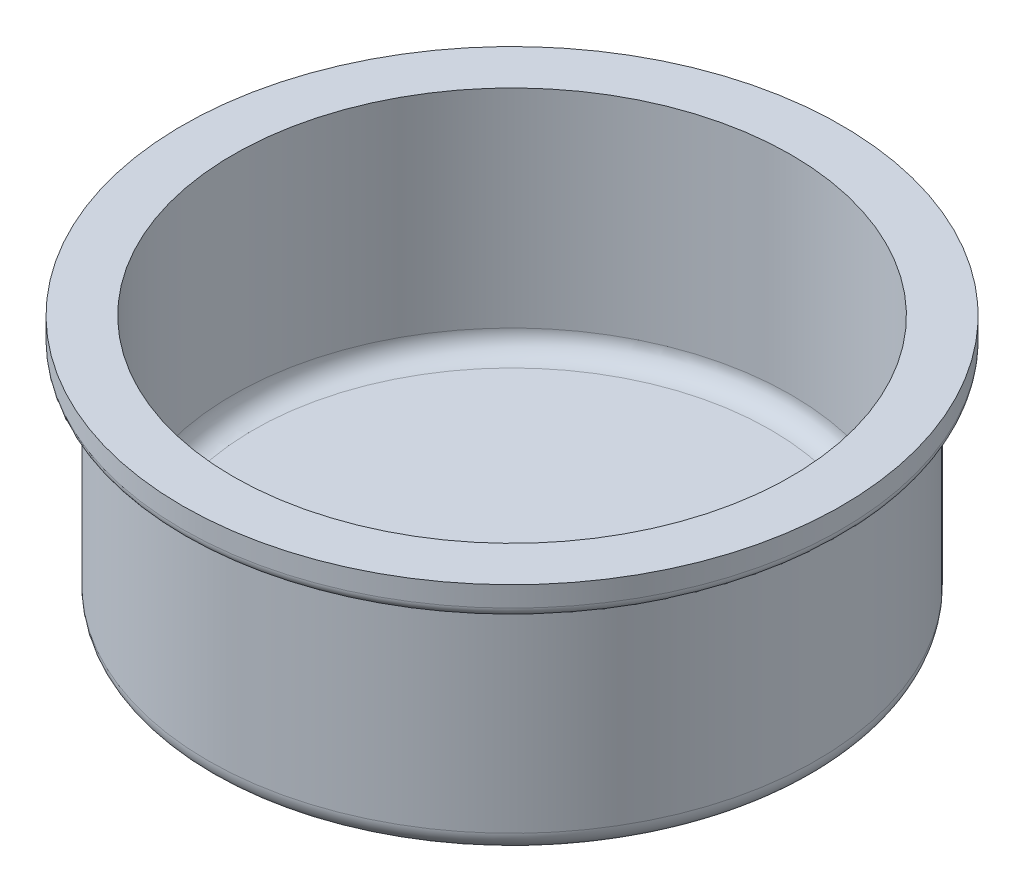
from build123d import *

# Parameters (mm, degrees)
CONG_1_R = 2
CONG_2_R = 1


with BuildPart() as part:
    # Esquisse1 → R_volution1 (revolve)
    with BuildSketch(Plane.XY, mode=Mode.PRIVATE) as r_volution1_sk:
        Polygon((0, 0), (30, 0), (30, 22), (32.5, 22), (32.5, 25), (27.5, 25), (27.5, 2.5), (0, 2.5), align=None)
    revolve(r_volution1_sk.sketch.rotate(Axis((0, 54.193953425, 0), (0, -1, 0)), 90), axis=Axis((0, 54.193953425, 0), (0, -1, 0)))

    # Cong_1
    cong_1_edges = [part.edges().sort_by_distance(p)[0] for p in [
        (0, 2.5, -27.5),
        (0, 0, -30),
    ]]
    fillet(cong_1_edges, radius=CONG_1_R)

    # Cong_2
    cong_2_edges = [part.edges().sort_by_distance(p)[0] for p in [
        (0, 22, -32.5),
        (0, 22, -30),
    ]]
    fillet(cong_2_edges, radius=CONG_2_R)


solid = part.part
